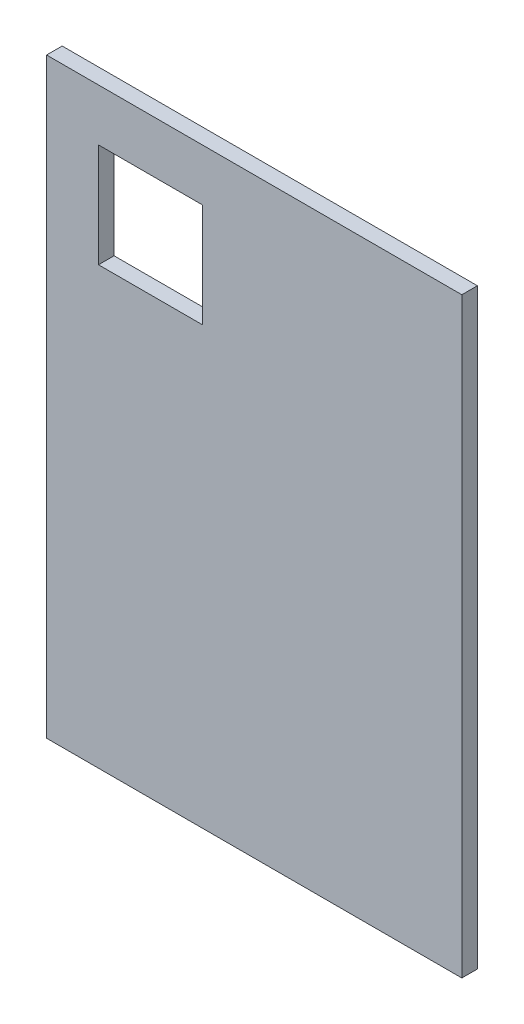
from build123d import *

# Parameters (mm, degrees)
CROQUIS1_W              = 400
CROQUIS1_H              = 570
SALIENTE_EXTRUIR1_DEPTH = 15
CROQUIS2_W              = 100
CROQUIS2_H              = 100
CORTAR_EXTRUIR1_DEPTH   = 15


with BuildPart() as part:
    # Croquis1 → Saliente-Extruir1 (new body)
    with BuildSketch(Plane.XY):
        Rectangle(CROQUIS1_W, CROQUIS1_H)
    extrude(amount=SALIENTE_EXTRUIR1_DEPTH)

    # Croquis2 → Cortar-Extruir1 (cut)
    with BuildSketch(Plane.XY.offset(15)):
        with Locations((-100, 185)):
            Rectangle(CROQUIS2_W, CROQUIS2_H)
    extrude(amount=-CORTAR_EXTRUIR1_DEPTH, mode=Mode.SUBTRACT)


solid = part.part
